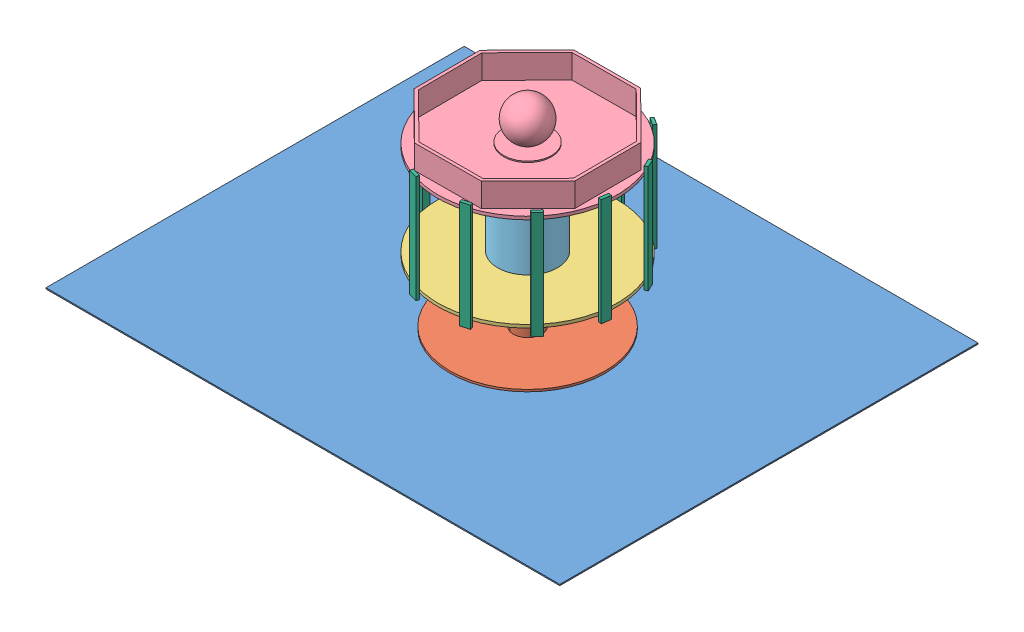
SolidWorks assembly MerryGoRound_Team15.SLDASM, configuration Default (file format 13000). Lengths in mm.
Overall size (546.1 215.82 444.5).
6 component instances, 6 part files, 4 mates.
Components (placement in the parent):
- MerryGoRound_Base_Team15-1: MerryGoRound_Base_Team15.SLDPRT [Default] at (52.2892 381.8238 433.3612) size (546.1 1.27 444.5)
- MerryGoRound_Axle_Team15-1: MerryGoRound_Axle_Team15.SLDPRT [Default] at (345.7264 401.172 659.4296) x (0.869262 0 -0.494351) z (0.494351 0 0.869262) size (165.1 168.4 165.1)
- MerryGoRound_BottomDisk_Team15-1: MerryGoRound_BottomDisk_Team15.SLDPRT [Default] at (345.7264 450.7555 659.4296) x (0.999999 0 -0.001513) z (0.001513 0 0.999999) size (190.5 3.3 190.5)
- MerryGoRound_TopDisk_Team15-1: MerryGoRound_TopDisk_Team15.SLDPRT [Default] at (345.7264 550.397 659.4296) size (190.5 47.24 190.5)
- MerryGoRound_Cylinder_Team15-1: MerryGoRound_Cylinder_Team15.SLDPRT [Default] at (345.7264 454.7417 659.4296) size (63.5 95.25 63.5)
- MerryGoRound_Divides_Team15-1: MerryGoRound_Divides_Team15.SLDPRT [Default] at (345.7264 444.9935 659.4296) x (0.999999 0 -0.001473) z (0.001473 0 0.999999) size (196.22 114.3 194.24)
Mates (geometry in assembly coordinates):
- Concentric1: concentric aligned: cylinder of MerryGoRound_Axle_Team15-1 through (345.7264 550.397 659.4296) axis (0 -1 0) radius 3.175; cylinder of MerryGoRound_BottomDisk_Team15-1 through (345.7264 454.0575 659.4296) axis (0 -1 0) radius 3.175
- Coincident3: coincident aligned: circle of MerryGoRound_Axle_Team15-1; circle of MerryGoRound_TopDisk_Team15-1
- Coincident4: coincident anti-aligned: cylinder of MerryGoRound_Axle_Team15-1 through (345.7264 550.397 659.4296) axis (0 -1 0) radius 3.175; circle of MerryGoRound_Cylinder_Team15-1
- Concentric3: concentric aligned: cylinder of MerryGoRound_TopDisk_Team15-1 through (345.7264 553.699 659.4296) axis (0 -1 0) radius 95.25; cylinder of MerryGoRound_Divides_Team15-1 through (345.7264 559.2935 659.4296) axis (0 -1 0) radius 95.25
